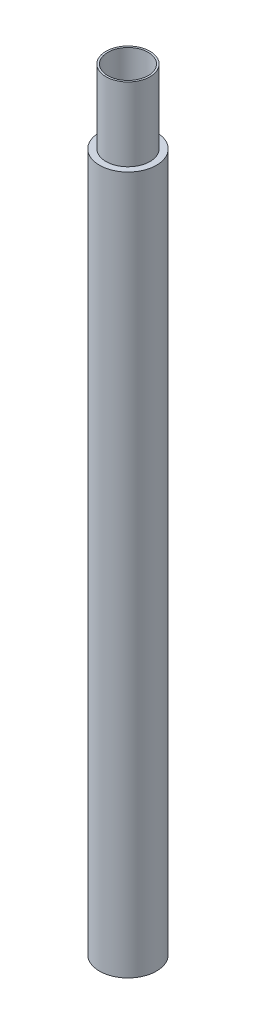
ISO-10303-21;
HEADER;
FILE_DESCRIPTION(('STEP AP214'),'2;1');
FILE_NAME('part.step','',(''),(''),'','','');
FILE_SCHEMA(('AUTOMOTIVE_DESIGN { 1 0 10303 214 1 1 1 1 }'));
ENDSEC;
DATA;
#1=APPLICATION_CONTEXT('core data for automotive mechanical design processes');
#2=APPLICATION_PROTOCOL_DEFINITION('international standard','automotive_design',2000,#1);
#3=PRODUCT_CONTEXT('',#1,'mechanical');
#4=PRODUCT('Part','Part','',(#3));
#5=PRODUCT_RELATED_PRODUCT_CATEGORY('part','',(#4));
#6=PRODUCT_DEFINITION_FORMATION('','',#4);
#7=PRODUCT_DEFINITION_CONTEXT('part definition',#1,'design');
#8=PRODUCT_DEFINITION('design','',#6,#7);
#9=PRODUCT_DEFINITION_SHAPE('','',#8);
#10=(LENGTH_UNIT() NAMED_UNIT(*) SI_UNIT(.MILLI.,.METRE.));
#11=(NAMED_UNIT(*) PLANE_ANGLE_UNIT() SI_UNIT($,.RADIAN.));
#12=(NAMED_UNIT(*) SI_UNIT($,.STERADIAN.) SOLID_ANGLE_UNIT());
#13=UNCERTAINTY_MEASURE_WITH_UNIT(LENGTH_MEASURE(1.E-05),#10,'distance_accuracy_value','');
#14=(GEOMETRIC_REPRESENTATION_CONTEXT(3) GLOBAL_UNCERTAINTY_ASSIGNED_CONTEXT((#13)) GLOBAL_UNIT_ASSIGNED_CONTEXT((#10,
#11,#12)) REPRESENTATION_CONTEXT('',''));
#15=CARTESIAN_POINT('',(0.,0.,0.));
#16=DIRECTION('',(0.,0.,1.));
#17=DIRECTION('',(1.,0.,0.));
#18=AXIS2_PLACEMENT_3D('',#15,#16,#17);
#19=CARTESIAN_POINT('',(70.,1150.,0.));
#20=DIRECTION('',(0.,1.,0.));
#21=DIRECTION('',(-1.,0.,0.));
#22=AXIS2_PLACEMENT_3D('',#19,#20,#21);
#23=CYLINDRICAL_SURFACE('',#22,77.5);
#24=CARTESIAN_POINT('',(70.,-950.,0.));
#25=DIRECTION('',(0.,1.,0.));
#26=DIRECTION('',(-1.,0.,0.));
#27=AXIS2_PLACEMENT_3D('',#24,#25,#26);
#28=CIRCLE('',#27,77.5);
#29=CARTESIAN_POINT('',(-7.49999999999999,-950.,0.));
#30=VERTEX_POINT('',#29);
#31=EDGE_CURVE('E10',#30,#30,#28,.T.);
#32=ORIENTED_EDGE('',*,*,#31,.T.);
#33=EDGE_LOOP('',(#32));
#34=FACE_BOUND('',#33,.T.);
#35=CARTESIAN_POINT('',(70.,950.,0.));
#36=DIRECTION('',(0.,1.,0.));
#37=DIRECTION('',(-1.,0.,0.));
#38=AXIS2_PLACEMENT_3D('',#35,#36,#37);
#39=CIRCLE('',#38,77.5);
#40=CARTESIAN_POINT('',(-7.49999999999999,950.,0.));
#41=VERTEX_POINT('',#40);
#42=EDGE_CURVE('E47',#41,#41,#39,.T.);
#43=ORIENTED_EDGE('',*,*,#42,.F.);
#44=EDGE_LOOP('',(#43));
#45=FACE_BOUND('',#44,.T.);
#46=ADVANCED_FACE('F33',(#34,#45),#23,.T.);
#47=CARTESIAN_POINT('',(70.,-950.,0.));
#48=DIRECTION('',(0.,-1.,0.));
#49=DIRECTION('',(1.,0.,0.));
#50=AXIS2_PLACEMENT_3D('',#47,#48,#49);
#51=PLANE('',#50);
#52=CARTESIAN_POINT('',(70.,-950.,0.));
#53=DIRECTION('',(0.,-1.,0.));
#54=DIRECTION('',(1.,0.,0.));
#55=AXIS2_PLACEMENT_3D('',#52,#53,#54);
#56=CIRCLE('',#55,72.5);
#57=CARTESIAN_POINT('',(142.5,-950.,0.));
#58=VERTEX_POINT('',#57);
#59=EDGE_CURVE('E61',#58,#58,#56,.T.);
#60=ORIENTED_EDGE('',*,*,#59,.F.);
#61=EDGE_LOOP('',(#60));
#62=FACE_BOUND('',#61,.T.);
#63=ORIENTED_EDGE('',*,*,#31,.F.);
#64=EDGE_LOOP('',(#63));
#65=FACE_BOUND('',#64,.T.);
#66=ADVANCED_FACE('F68',(#62,#65),#51,.T.);
#67=CARTESIAN_POINT('',(70.,1150.,0.));
#68=DIRECTION('',(0.,1.,0.));
#69=DIRECTION('',(-1.,0.,0.));
#70=AXIS2_PLACEMENT_3D('',#67,#68,#69);
#71=PLANE('',#70);
#72=CARTESIAN_POINT('',(70.,1150.,0.));
#73=DIRECTION('',(0.,1.,0.));
#74=DIRECTION('',(-1.,0.,0.));
#75=AXIS2_PLACEMENT_3D('',#72,#73,#74);
#76=CIRCLE('',#75,55.0000000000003);
#77=CARTESIAN_POINT('',(14.9999999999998,1150.,0.));
#78=VERTEX_POINT('',#77);
#79=EDGE_CURVE('E52',#78,#78,#76,.T.);
#80=ORIENTED_EDGE('',*,*,#79,.F.);
#81=EDGE_LOOP('',(#80));
#82=FACE_BOUND('',#81,.T.);
#83=CARTESIAN_POINT('',(70.,1150.,0.));
#84=DIRECTION('',(0.,1.,0.));
#85=DIRECTION('',(-1.,0.,0.));
#86=AXIS2_PLACEMENT_3D('',#83,#84,#85);
#87=CIRCLE('',#86,60.0000000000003);
#88=CARTESIAN_POINT('',(9.99999999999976,1150.,0.));
#89=VERTEX_POINT('',#88);
#90=EDGE_CURVE('E39',#89,#89,#87,.T.);
#91=ORIENTED_EDGE('',*,*,#90,.T.);
#92=EDGE_LOOP('',(#91));
#93=FACE_BOUND('',#92,.T.);
#94=ADVANCED_FACE('F71',(#82,#93),#71,.T.);
#95=CARTESIAN_POINT('',(70.,1150.,0.));
#96=DIRECTION('',(0.,1.,0.));
#97=DIRECTION('',(-1.,0.,0.));
#98=AXIS2_PLACEMENT_3D('',#95,#96,#97);
#99=CYLINDRICAL_SURFACE('',#98,60.0000000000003);
#100=CARTESIAN_POINT('',(70.,950.,0.));
#101=DIRECTION('',(0.,1.,0.));
#102=DIRECTION('',(-1.,0.,0.));
#103=AXIS2_PLACEMENT_3D('',#100,#101,#102);
#104=CIRCLE('',#103,60.0000000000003);
#105=CARTESIAN_POINT('',(9.99999999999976,950.,0.));
#106=VERTEX_POINT('',#105);
#107=EDGE_CURVE('E43',#106,#106,#104,.T.);
#108=ORIENTED_EDGE('',*,*,#107,.T.);
#109=EDGE_LOOP('',(#108));
#110=FACE_BOUND('',#109,.T.);
#111=ORIENTED_EDGE('',*,*,#90,.F.);
#112=EDGE_LOOP('',(#111));
#113=FACE_BOUND('',#112,.T.);
#114=ADVANCED_FACE('F76',(#110,#113),#99,.T.);
#115=CARTESIAN_POINT('',(9.99999999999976,950.,0.));
#116=DIRECTION('',(0.,1.,0.));
#117=DIRECTION('',(-1.,0.,0.));
#118=AXIS2_PLACEMENT_3D('',#115,#116,#117);
#119=PLANE('',#118);
#120=ORIENTED_EDGE('',*,*,#42,.T.);
#121=EDGE_LOOP('',(#120));
#122=FACE_BOUND('',#121,.T.);
#123=ORIENTED_EDGE('',*,*,#107,.F.);
#124=EDGE_LOOP('',(#123));
#125=FACE_BOUND('',#124,.T.);
#126=ADVANCED_FACE('F82',(#122,#125),#119,.T.);
#127=CARTESIAN_POINT('',(70.,1150.,0.));
#128=DIRECTION('',(0.,1.,0.));
#129=DIRECTION('',(-1.,0.,0.));
#130=AXIS2_PLACEMENT_3D('',#127,#128,#129);
#131=CYLINDRICAL_SURFACE('',#130,72.5);
#132=ORIENTED_EDGE('',*,*,#59,.T.);
#133=EDGE_LOOP('',(#132));
#134=FACE_BOUND('',#133,.T.);
#135=CARTESIAN_POINT('',(70.,945.,0.));
#136=DIRECTION('',(0.,1.,0.));
#137=DIRECTION('',(-1.,0.,0.));
#138=AXIS2_PLACEMENT_3D('',#135,#136,#137);
#139=CIRCLE('',#138,72.5);
#140=CARTESIAN_POINT('',(-2.49999999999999,945.,0.));
#141=VERTEX_POINT('',#140);
#142=EDGE_CURVE('E58',#141,#141,#139,.T.);
#143=ORIENTED_EDGE('',*,*,#142,.T.);
#144=EDGE_LOOP('',(#143));
#145=FACE_BOUND('',#144,.T.);
#146=ADVANCED_FACE('F65',(#134,#145),#131,.F.);
#147=CARTESIAN_POINT('',(70.,1150.,0.));
#148=DIRECTION('',(0.,1.,0.));
#149=DIRECTION('',(-1.,0.,0.));
#150=AXIS2_PLACEMENT_3D('',#147,#148,#149);
#151=CYLINDRICAL_SURFACE('',#150,55.0000000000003);
#152=CARTESIAN_POINT('',(70.,945.,0.));
#153=DIRECTION('',(0.,1.,0.));
#154=DIRECTION('',(-1.,0.,0.));
#155=AXIS2_PLACEMENT_3D('',#152,#153,#154);
#156=CIRCLE('',#155,55.0000000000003);
#157=CARTESIAN_POINT('',(14.9999999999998,945.,0.));
#158=VERTEX_POINT('',#157);
#159=EDGE_CURVE('E55',#158,#158,#156,.T.);
#160=ORIENTED_EDGE('',*,*,#159,.F.);
#161=EDGE_LOOP('',(#160));
#162=FACE_BOUND('',#161,.T.);
#163=ORIENTED_EDGE('',*,*,#79,.T.);
#164=EDGE_LOOP('',(#163));
#165=FACE_BOUND('',#164,.T.);
#166=ADVANCED_FACE('F90',(#162,#165),#151,.F.);
#167=CARTESIAN_POINT('',(9.99999999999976,945.,0.));
#168=DIRECTION('',(0.,1.,0.));
#169=DIRECTION('',(-1.,0.,0.));
#170=AXIS2_PLACEMENT_3D('',#167,#168,#169);
#171=PLANE('',#170);
#172=ORIENTED_EDGE('',*,*,#142,.F.);
#173=EDGE_LOOP('',(#172));
#174=FACE_BOUND('',#173,.T.);
#175=ORIENTED_EDGE('',*,*,#159,.T.);
#176=EDGE_LOOP('',(#175));
#177=FACE_BOUND('',#176,.T.);
#178=ADVANCED_FACE('F87',(#174,#177),#171,.F.);
#179=CLOSED_SHELL('',(#46,#66,#94,#114,#126,#146,#166,#178));
#180=MANIFOLD_SOLID_BREP('B2',#179);
#181=ADVANCED_BREP_SHAPE_REPRESENTATION('',(#18,#180),#14);
#182=SHAPE_DEFINITION_REPRESENTATION(#9,#181);
ENDSEC;
END-ISO-10303-21;
